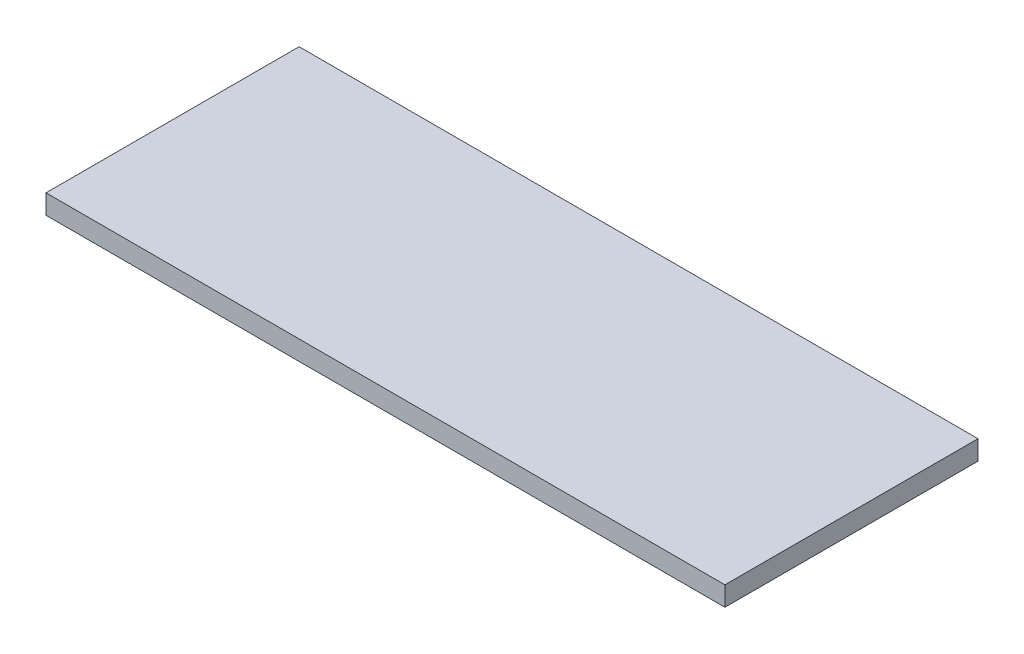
ISO-10303-21;
HEADER;
FILE_DESCRIPTION(('STEP AP214'),'2;1');
FILE_NAME('part.step','',(''),(''),'','','');
FILE_SCHEMA(('AUTOMOTIVE_DESIGN { 1 0 10303 214 1 1 1 1 }'));
ENDSEC;
DATA;
#1=APPLICATION_CONTEXT('core data for automotive mechanical design processes');
#2=APPLICATION_PROTOCOL_DEFINITION('international standard','automotive_design',2000,#1);
#3=PRODUCT_CONTEXT('',#1,'mechanical');
#4=PRODUCT('Part','Part','',(#3));
#5=PRODUCT_RELATED_PRODUCT_CATEGORY('part','',(#4));
#6=PRODUCT_DEFINITION_FORMATION('','',#4);
#7=PRODUCT_DEFINITION_CONTEXT('part definition',#1,'design');
#8=PRODUCT_DEFINITION('design','',#6,#7);
#9=PRODUCT_DEFINITION_SHAPE('','',#8);
#10=(LENGTH_UNIT() NAMED_UNIT(*) SI_UNIT(.MILLI.,.METRE.));
#11=(NAMED_UNIT(*) PLANE_ANGLE_UNIT() SI_UNIT($,.RADIAN.));
#12=(NAMED_UNIT(*) SI_UNIT($,.STERADIAN.) SOLID_ANGLE_UNIT());
#13=UNCERTAINTY_MEASURE_WITH_UNIT(LENGTH_MEASURE(1.E-05),#10,'distance_accuracy_value','');
#14=(GEOMETRIC_REPRESENTATION_CONTEXT(3) GLOBAL_UNCERTAINTY_ASSIGNED_CONTEXT((#13)) GLOBAL_UNIT_ASSIGNED_CONTEXT((#10,
#11,#12)) REPRESENTATION_CONTEXT('',''));
#15=CARTESIAN_POINT('',(0.,0.,0.));
#16=DIRECTION('',(0.,0.,1.));
#17=DIRECTION('',(1.,0.,0.));
#18=AXIS2_PLACEMENT_3D('',#15,#16,#17);
#19=CARTESIAN_POINT('',(-55.36565,3.175,-20.6375));
#20=DIRECTION('',(1.,0.,0.));
#21=DIRECTION('',(0.,0.,-1.));
#22=AXIS2_PLACEMENT_3D('',#19,#20,#21);
#23=PLANE('',#22);
#24=DIRECTION('',(0.,0.,1.));
#25=VECTOR('',#24,1.);
#26=CARTESIAN_POINT('',(-55.36565,0.,-20.6375));
#27=LINE('',#26,#25);
#28=CARTESIAN_POINT('',(-55.36565,0.,-20.6375));
#29=VERTEX_POINT('',#28);
#30=CARTESIAN_POINT('',(-55.36565,0.,20.6375));
#31=VERTEX_POINT('',#30);
#32=EDGE_CURVE('E99',#29,#31,#27,.T.);
#33=ORIENTED_EDGE('',*,*,#32,.T.);
#34=DIRECTION('',(0.,-1.,0.));
#35=VECTOR('',#34,1.);
#36=CARTESIAN_POINT('',(-55.36565,3.175,20.6375));
#37=LINE('',#36,#35);
#38=CARTESIAN_POINT('',(-55.36565,3.175,20.6375));
#39=VERTEX_POINT('',#38);
#40=EDGE_CURVE('E11',#39,#31,#37,.T.);
#41=ORIENTED_EDGE('',*,*,#40,.F.);
#42=DIRECTION('',(0.,0.,1.));
#43=VECTOR('',#42,1.);
#44=CARTESIAN_POINT('',(-55.36565,3.175,-20.6375));
#45=LINE('',#44,#43);
#46=CARTESIAN_POINT('',(-55.36565,3.175,-20.6375));
#47=VERTEX_POINT('',#46);
#48=EDGE_CURVE('E87',#47,#39,#45,.T.);
#49=ORIENTED_EDGE('',*,*,#48,.F.);
#50=DIRECTION('',(0.,-1.,0.));
#51=VECTOR('',#50,1.);
#52=CARTESIAN_POINT('',(-55.36565,3.175,-20.6375));
#53=LINE('',#52,#51);
#54=EDGE_CURVE('E95',#47,#29,#53,.T.);
#55=ORIENTED_EDGE('',*,*,#54,.T.);
#56=EDGE_LOOP('',(#33,#41,#49,#55));
#57=FACE_BOUND('',#56,.T.);
#58=ADVANCED_FACE('F36',(#57),#23,.F.);
#59=CARTESIAN_POINT('',(-55.36565,3.175,20.6375));
#60=DIRECTION('',(0.,0.,-1.));
#61=DIRECTION('',(-1.,0.,0.));
#62=AXIS2_PLACEMENT_3D('',#59,#60,#61);
#63=PLANE('',#62);
#64=DIRECTION('',(1.,0.,0.));
#65=VECTOR('',#64,1.);
#66=CARTESIAN_POINT('',(-55.36565,0.,20.6375));
#67=LINE('',#66,#65);
#68=CARTESIAN_POINT('',(55.36565,0.,20.6375));
#69=VERTEX_POINT('',#68);
#70=EDGE_CURVE('E91',#31,#69,#67,.T.);
#71=ORIENTED_EDGE('',*,*,#70,.T.);
#72=DIRECTION('',(0.,-1.,0.));
#73=VECTOR('',#72,1.);
#74=CARTESIAN_POINT('',(55.36565,3.175,20.6375));
#75=LINE('',#74,#73);
#76=CARTESIAN_POINT('',(55.36565,3.175,20.6375));
#77=VERTEX_POINT('',#76);
#78=EDGE_CURVE('E44',#77,#69,#75,.T.);
#79=ORIENTED_EDGE('',*,*,#78,.F.);
#80=DIRECTION('',(1.,0.,0.));
#81=VECTOR('',#80,1.);
#82=CARTESIAN_POINT('',(-55.36565,3.175,20.6375));
#83=LINE('',#82,#81);
#84=EDGE_CURVE('E82',#39,#77,#83,.T.);
#85=ORIENTED_EDGE('',*,*,#84,.F.);
#86=ORIENTED_EDGE('',*,*,#40,.T.);
#87=EDGE_LOOP('',(#71,#79,#85,#86));
#88=FACE_BOUND('',#87,.T.);
#89=ADVANCED_FACE('F90',(#88),#63,.F.);
#90=CARTESIAN_POINT('',(55.36565,3.175,-20.6375));
#91=DIRECTION('',(-1.,0.,0.));
#92=DIRECTION('',(0.,0.,1.));
#93=AXIS2_PLACEMENT_3D('',#90,#91,#92);
#94=PLANE('',#93);
#95=DIRECTION('',(0.,0.,-1.));
#96=VECTOR('',#95,1.);
#97=CARTESIAN_POINT('',(55.36565,0.,-20.6375));
#98=LINE('',#97,#96);
#99=CARTESIAN_POINT('',(55.36565,0.,-20.6375));
#100=VERTEX_POINT('',#99);
#101=EDGE_CURVE('E69',#69,#100,#98,.T.);
#102=ORIENTED_EDGE('',*,*,#101,.T.);
#103=DIRECTION('',(0.,-1.,0.));
#104=VECTOR('',#103,1.);
#105=CARTESIAN_POINT('',(55.36565,3.175,-20.6375));
#106=LINE('',#105,#104);
#107=CARTESIAN_POINT('',(55.36565,3.175,-20.6375));
#108=VERTEX_POINT('',#107);
#109=EDGE_CURVE('E92',#108,#100,#106,.T.);
#110=ORIENTED_EDGE('',*,*,#109,.F.);
#111=DIRECTION('',(0.,0.,-1.));
#112=VECTOR('',#111,1.);
#113=CARTESIAN_POINT('',(55.36565,3.175,-20.6375));
#114=LINE('',#113,#112);
#115=EDGE_CURVE('E85',#77,#108,#114,.T.);
#116=ORIENTED_EDGE('',*,*,#115,.F.);
#117=ORIENTED_EDGE('',*,*,#78,.T.);
#118=EDGE_LOOP('',(#102,#110,#116,#117));
#119=FACE_BOUND('',#118,.T.);
#120=ADVANCED_FACE('F93',(#119),#94,.F.);
#121=CARTESIAN_POINT('',(-55.36565,3.175,-20.6375));
#122=DIRECTION('',(0.,0.,1.));
#123=DIRECTION('',(1.,0.,0.));
#124=AXIS2_PLACEMENT_3D('',#121,#122,#123);
#125=PLANE('',#124);
#126=DIRECTION('',(-1.,0.,0.));
#127=VECTOR('',#126,1.);
#128=CARTESIAN_POINT('',(-55.36565,0.,-20.6375));
#129=LINE('',#128,#127);
#130=EDGE_CURVE('E75',#100,#29,#129,.T.);
#131=ORIENTED_EDGE('',*,*,#130,.T.);
#132=ORIENTED_EDGE('',*,*,#54,.F.);
#133=DIRECTION('',(-1.,0.,0.));
#134=VECTOR('',#133,1.);
#135=CARTESIAN_POINT('',(-55.36565,3.175,-20.6375));
#136=LINE('',#135,#134);
#137=EDGE_CURVE('E52',#108,#47,#136,.T.);
#138=ORIENTED_EDGE('',*,*,#137,.F.);
#139=ORIENTED_EDGE('',*,*,#109,.T.);
#140=EDGE_LOOP('',(#131,#132,#138,#139));
#141=FACE_BOUND('',#140,.T.);
#142=ADVANCED_FACE('F106',(#141),#125,.F.);
#143=CARTESIAN_POINT('',(0.,3.175,0.));
#144=DIRECTION('',(0.,1.,0.));
#145=DIRECTION('',(0.,0.,1.));
#146=AXIS2_PLACEMENT_3D('',#143,#144,#145);
#147=PLANE('',#146);
#148=ORIENTED_EDGE('',*,*,#48,.T.);
#149=ORIENTED_EDGE('',*,*,#84,.T.);
#150=ORIENTED_EDGE('',*,*,#115,.T.);
#151=ORIENTED_EDGE('',*,*,#137,.T.);
#152=EDGE_LOOP('',(#148,#149,#150,#151));
#153=FACE_BOUND('',#152,.T.);
#154=ADVANCED_FACE('F83',(#153),#147,.T.);
#155=CARTESIAN_POINT('',(0.,0.,0.));
#156=DIRECTION('',(0.,1.,0.));
#157=DIRECTION('',(0.,0.,1.));
#158=AXIS2_PLACEMENT_3D('',#155,#156,#157);
#159=PLANE('',#158);
#160=ORIENTED_EDGE('',*,*,#32,.F.);
#161=ORIENTED_EDGE('',*,*,#130,.F.);
#162=ORIENTED_EDGE('',*,*,#101,.F.);
#163=ORIENTED_EDGE('',*,*,#70,.F.);
#164=EDGE_LOOP('',(#160,#161,#162,#163));
#165=FACE_BOUND('',#164,.T.);
#166=ADVANCED_FACE('F109',(#165),#159,.F.);
#167=CLOSED_SHELL('',(#58,#89,#120,#142,#154,#166));
#168=MANIFOLD_SOLID_BREP('B2',#167);
#169=ADVANCED_BREP_SHAPE_REPRESENTATION('',(#18,#168),#14);
#170=SHAPE_DEFINITION_REPRESENTATION(#9,#169);
ENDSEC;
END-ISO-10303-21;
